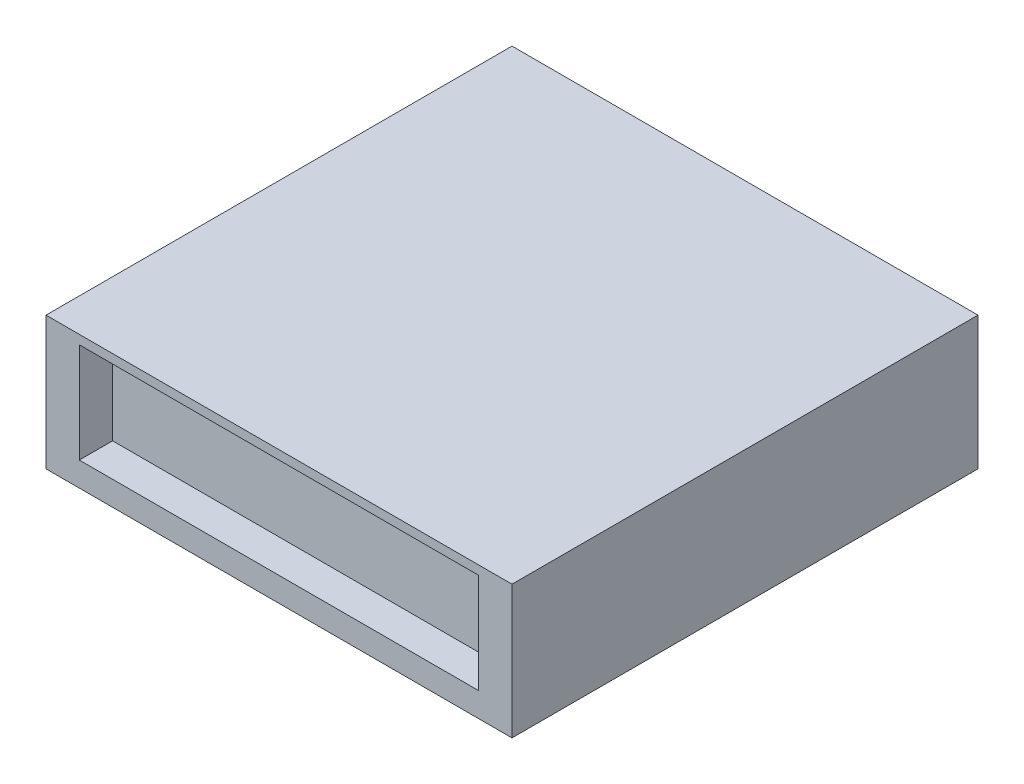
from build123d import *

# Parameters (mm, degrees)
SKETCH1_W           = 88.9
SKETCH1_H           = 88.9
BOSS_EXTRUDE1_DEPTH = 25.4
SKETCH2_W           = 76.2
SKETCH2_H           = 19.05
CUT_EXTRUDE1_DEPTH  = 6.35


with BuildPart() as part:
    # Sketch1 → Boss-Extrude1 (new body)
    with BuildSketch(Plane(origin=(0, 0, 0), x_dir=(1, 0, 0), z_dir=(0, 1, 0))):
        with Locations((44.45, 44.45)):
            Rectangle(SKETCH1_W, SKETCH1_H)
    extrude(amount=BOSS_EXTRUDE1_DEPTH)

    # Sketch2 → Cut-Extrude1 (cut)
    with BuildSketch(Plane.XY):
        with Locations((44.45, 14.158077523)):
            Rectangle(SKETCH2_W, SKETCH2_H)
    extrude(amount=-CUT_EXTRUDE1_DEPTH, mode=Mode.SUBTRACT)


solid = part.part
